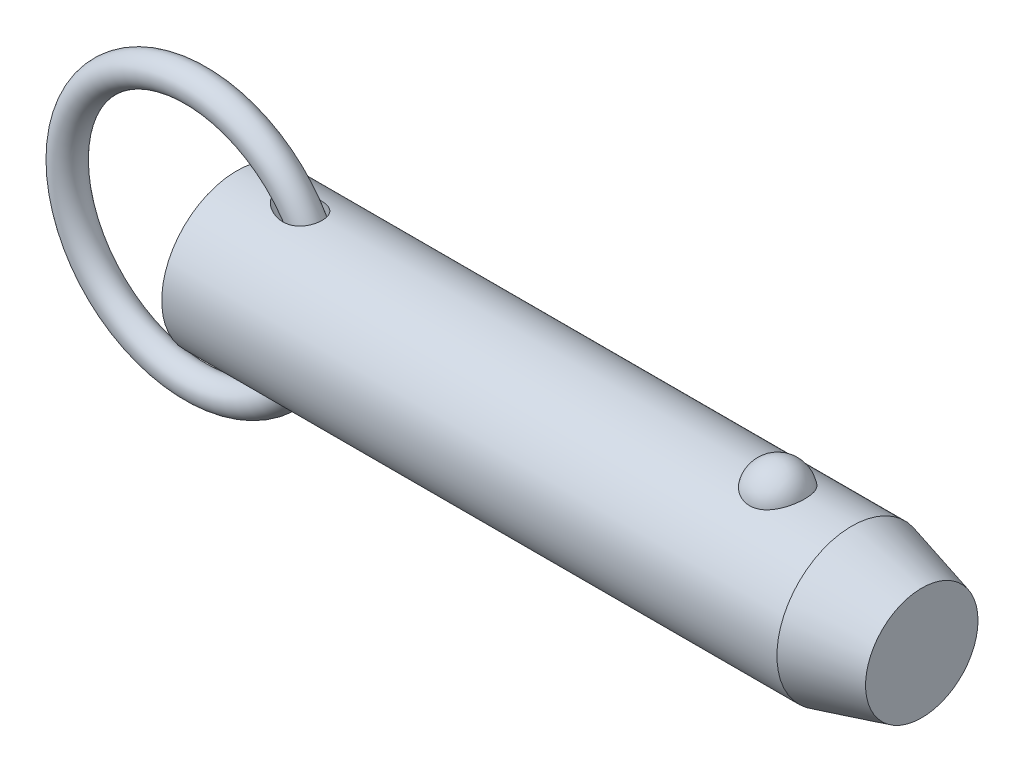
ISO-10303-21;
HEADER;
FILE_DESCRIPTION(('STEP AP214'),'2;1');
FILE_NAME('part.step','',(''),(''),'','','');
FILE_SCHEMA(('AUTOMOTIVE_DESIGN { 1 0 10303 214 1 1 1 1 }'));
ENDSEC;
DATA;
#1=APPLICATION_CONTEXT('core data for automotive mechanical design processes');
#2=APPLICATION_PROTOCOL_DEFINITION('international standard','automotive_design',2000,#1);
#3=PRODUCT_CONTEXT('',#1,'mechanical');
#4=PRODUCT('Part','Part','',(#3));
#5=PRODUCT_RELATED_PRODUCT_CATEGORY('part','',(#4));
#6=PRODUCT_DEFINITION_FORMATION('','',#4);
#7=PRODUCT_DEFINITION_CONTEXT('part definition',#1,'design');
#8=PRODUCT_DEFINITION('design','',#6,#7);
#9=PRODUCT_DEFINITION_SHAPE('','',#8);
#10=(LENGTH_UNIT() NAMED_UNIT(*) SI_UNIT(.MILLI.,.METRE.));
#11=(NAMED_UNIT(*) PLANE_ANGLE_UNIT() SI_UNIT($,.RADIAN.));
#12=(NAMED_UNIT(*) SI_UNIT($,.STERADIAN.) SOLID_ANGLE_UNIT());
#13=UNCERTAINTY_MEASURE_WITH_UNIT(LENGTH_MEASURE(1.E-05),#10,'distance_accuracy_value','');
#14=(GEOMETRIC_REPRESENTATION_CONTEXT(3) GLOBAL_UNCERTAINTY_ASSIGNED_CONTEXT((#13)) GLOBAL_UNIT_ASSIGNED_CONTEXT((#10,
#11,#12)) REPRESENTATION_CONTEXT('',''));
#15=CARTESIAN_POINT('',(0.,0.,0.));
#16=DIRECTION('',(0.,0.,1.));
#17=DIRECTION('',(1.,0.,0.));
#18=AXIS2_PLACEMENT_3D('',#15,#16,#17);
#19=CARTESIAN_POINT('',(-6.08699288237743,0.,0.));
#20=DIRECTION('',(0.,0.,1.));
#21=DIRECTION('',(1.,0.,0.));
#22=AXIS2_PLACEMENT_3D('',#19,#20,#21);
#23=TOROIDAL_SURFACE('',#22,19.05,2.223);
#24=CARTESIAN_POINT('',(15.1860071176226,0.,0.));
#25=VERTEX_POINT('',#24);
#26=VERTEX_LOOP('',#25);
#27=FACE_BOUND('',#26,.T.);
#28=ADVANCED_FACE('P0_F12',(#27),#23,.T.);
#29=CLOSED_SHELL('',(#28));
#30=MANIFOLD_SOLID_BREP('P0_B1',#29);
#31=CARTESIAN_POINT('',(0.,0.,0.));
#32=DIRECTION('',(1.,0.,0.));
#33=DIRECTION('',(0.,0.,-1.));
#34=AXIS2_PLACEMENT_3D('',#31,#32,#33);
#35=CYLINDRICAL_SURFACE('',#34,11.115);
#36=CARTESIAN_POINT('',(6.41405181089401,11.0227946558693,-1.4287136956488));
#37=CARTESIAN_POINT('',(6.49338916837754,11.0115377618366,-1.51556642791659));
#38=CARTESIAN_POINT('',(6.57765461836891,10.9998263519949,-1.59789397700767));
#39=CARTESIAN_POINT('',(6.75386647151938,10.9760304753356,-1.75391400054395));
#40=CARTESIAN_POINT('',(6.84582247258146,10.9639455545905,-1.82759540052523));
#41=CARTESIAN_POINT('',(7.03627827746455,10.9397989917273,-1.96698954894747));
#42=CARTESIAN_POINT('',(7.13480838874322,10.9277377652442,-2.03266078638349));
#43=CARTESIAN_POINT('',(7.33681032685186,10.9041015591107,-2.1558582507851));
#44=CARTESIAN_POINT('',(7.44028007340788,10.8925263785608,-2.21338786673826));
#45=CARTESIAN_POINT('',(7.64386117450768,10.8710104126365,-2.31666528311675));
#46=CARTESIAN_POINT('',(7.74368989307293,10.8610119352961,-2.36295942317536));
#47=CARTESIAN_POINT('',(7.94637195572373,10.8420168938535,-2.44863486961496));
#48=CARTESIAN_POINT('',(8.04922612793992,10.8330206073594,-2.48801426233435));
#49=CARTESIAN_POINT('',(8.36115573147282,10.807980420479,-2.59542730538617));
#50=CARTESIAN_POINT('',(8.57411849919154,10.7938278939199,-2.65299817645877));
#51=CARTESIAN_POINT('',(9.00825016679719,10.7725818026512,-2.73800108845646));
#52=CARTESIAN_POINT('',(9.22947335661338,10.7655491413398,-2.76517330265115));
#53=CARTESIAN_POINT('',(9.67368141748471,10.7605872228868,-2.78445308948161));
#54=CARTESIAN_POINT('',(9.89666486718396,10.7626512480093,-2.77658653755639));
#55=CARTESIAN_POINT('',(10.2950172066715,10.7754452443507,-2.72644436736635));
#56=CARTESIAN_POINT('',(10.4712789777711,10.7844280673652,-2.69109376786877));
#57=CARTESIAN_POINT('',(10.7292776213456,10.8024982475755,-2.61722365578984));
#58=CARTESIAN_POINT('',(10.8142337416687,10.8092901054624,-2.58911576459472));
#59=CARTESIAN_POINT('',(10.9813218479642,10.8242580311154,-2.52581287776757));
#60=CARTESIAN_POINT('',(11.0634550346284,10.8324335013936,-2.49062094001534));
#61=CARTESIAN_POINT('',(11.2247418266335,10.8500287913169,-2.41281958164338));
#62=CARTESIAN_POINT('',(11.3038694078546,10.8594572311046,-2.37015806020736));
#63=CARTESIAN_POINT('',(11.4576781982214,10.8792243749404,-2.27770403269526));
#64=CARTESIAN_POINT('',(11.5323615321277,10.8895626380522,-2.22791497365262));
#65=CARTESIAN_POINT('',(11.6765388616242,10.9108113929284,-2.12140590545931));
#66=CARTESIAN_POINT('',(11.7460329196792,10.9217218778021,-2.06468597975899));
#67=CARTESIAN_POINT('',(11.8790597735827,10.9437207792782,-1.94471764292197));
#68=CARTESIAN_POINT('',(11.9425932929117,10.9548091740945,-1.88147002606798));
#69=CARTESIAN_POINT('',(12.109388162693,10.9851999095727,-1.69784918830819));
#70=CARTESIAN_POINT('',(12.205655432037,11.0042655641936,-1.57093023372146));
#71=CARTESIAN_POINT('',(12.374151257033,11.0393391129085,-1.3017676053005));
#72=CARTESIAN_POINT('',(12.4463875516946,11.0553479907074,-1.15952888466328));
#73=CARTESIAN_POINT('',(12.5615818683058,11.0816338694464,-0.871972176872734));
#74=CARTESIAN_POINT('',(12.6058896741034,11.0921698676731,-0.727217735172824));
#75=CARTESIAN_POINT('',(12.6699315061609,11.1075802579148,-0.432089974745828));
#76=CARTESIAN_POINT('',(12.6896681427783,11.1124552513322,-0.281717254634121));
#77=CARTESIAN_POINT('',(12.7040225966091,11.1159901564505,0.0188164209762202));
#78=CARTESIAN_POINT('',(12.6988836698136,11.1147102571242,0.168965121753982));
#79=CARTESIAN_POINT('',(12.6641681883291,11.1062126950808,0.466238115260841));
#80=CARTESIAN_POINT('',(12.6345920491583,11.0989951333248,0.61336245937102));
#81=CARTESIAN_POINT('',(12.5517453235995,11.0794095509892,0.900330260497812));
#82=CARTESIAN_POINT('',(12.4984878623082,11.0670443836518,1.0401777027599));
#83=CARTESIAN_POINT('',(12.3696588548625,11.0385082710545,1.308745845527));
#84=CARTESIAN_POINT('',(12.2940887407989,11.0223375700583,1.43746725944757));
#85=CARTESIAN_POINT('',(12.122380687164,10.987872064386,1.68079704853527));
#86=CARTESIAN_POINT('',(12.0261637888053,10.969569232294,1.79534850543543));
#87=CARTESIAN_POINT('',(11.8161707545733,10.932836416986,2.00695695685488));
#88=CARTESIAN_POINT('',(11.7023941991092,10.9144064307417,2.10401353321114));
#89=CARTESIAN_POINT('',(11.4575656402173,10.8788057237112,2.28105326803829));
#90=CARTESIAN_POINT('',(11.3261451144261,10.8616794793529,2.36053412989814));
#91=CARTESIAN_POINT('',(11.0523589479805,10.8308019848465,2.49839044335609));
#92=CARTESIAN_POINT('',(10.9099908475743,10.8170514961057,2.55676113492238));
#93=CARTESIAN_POINT('',(10.6060622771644,10.7929728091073,2.65666105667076));
#94=CARTESIAN_POINT('',(10.4438877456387,10.7830209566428,2.69640163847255));
#95=CARTESIAN_POINT('',(10.1154037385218,10.7687230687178,2.75293129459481));
#96=CARTESIAN_POINT('',(9.94909141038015,10.7643810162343,2.76970406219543));
#97=CARTESIAN_POINT('',(9.54387061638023,10.7604809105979,2.7848723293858));
#98=CARTESIAN_POINT('',(9.30446860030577,10.7637793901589,2.77227753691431));
#99=CARTESIAN_POINT('',(8.9496125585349,10.7757341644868,2.72524141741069));
#100=CARTESIAN_POINT('',(8.83186896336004,10.7808994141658,2.70482239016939));
#101=CARTESIAN_POINT('',(8.59835142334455,10.7932548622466,2.6550999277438));
#102=CARTESIAN_POINT('',(8.48257728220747,10.8004448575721,2.62579738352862));
#103=CARTESIAN_POINT('',(8.25208469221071,10.8166382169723,2.55827624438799));
#104=CARTESIAN_POINT('',(8.13740214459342,10.8256649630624,2.51994155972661));
#105=CARTESIAN_POINT('',(7.91132058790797,10.8451170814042,2.43486475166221));
#106=CARTESIAN_POINT('',(7.79992154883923,10.8555424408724,2.38812270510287));
#107=CARTESIAN_POINT('',(7.58115677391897,10.8774251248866,2.28638483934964));
#108=CARTESIAN_POINT('',(7.47378802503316,10.8888816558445,2.23139534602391));
#109=CARTESIAN_POINT('',(7.26385624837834,10.9124540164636,2.1131026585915));
#110=CARTESIAN_POINT('',(7.16129168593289,10.9245696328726,2.04980214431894));
#111=CARTESIAN_POINT('',(6.91882218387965,10.9543689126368,1.88540538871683));
#112=CARTESIAN_POINT('',(6.78193778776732,10.9721958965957,1.77979827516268));
#113=CARTESIAN_POINT('',(6.5247244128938,11.0070222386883,1.54989693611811));
#114=CARTESIAN_POINT('',(6.40436902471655,11.0240228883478,1.42563320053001));
#115=CARTESIAN_POINT('',(6.21838804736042,11.0509658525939,1.19529359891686));
#116=CARTESIAN_POINT('',(6.14691885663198,11.0615430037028,1.09404520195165));
#117=CARTESIAN_POINT('',(6.02043496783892,11.0805004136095,0.881508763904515));
#118=CARTESIAN_POINT('',(5.96539400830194,11.0888841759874,0.770237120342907));
#119=CARTESIAN_POINT('',(5.88475453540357,11.1012553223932,0.560577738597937));
#120=CARTESIAN_POINT('',(5.85559643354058,11.1057686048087,0.463603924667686));
#121=CARTESIAN_POINT('',(5.81381299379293,11.1122523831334,0.266083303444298));
#122=CARTESIAN_POINT('',(5.80117118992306,11.1142254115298,0.165540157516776));
#123=CARTESIAN_POINT('',(5.79363815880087,11.1153999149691,-0.036474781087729));
#124=CARTESIAN_POINT('',(5.79878799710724,11.1145949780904,-0.137948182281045));
#125=CARTESIAN_POINT('',(5.82639592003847,11.1102987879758,-0.338493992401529));
#126=CARTESIAN_POINT('',(5.84887234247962,11.1068046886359,-0.43756374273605));
#127=CARTESIAN_POINT('',(5.91510741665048,11.0965857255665,-0.649968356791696));
#128=CARTESIAN_POINT('',(5.9622090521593,11.0893566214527,-0.762222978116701));
#129=CARTESIAN_POINT('',(6.07378449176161,11.072471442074,-0.977396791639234));
#130=CARTESIAN_POINT('',(6.13826787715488,11.0628140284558,-1.08031079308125));
#131=CARTESIAN_POINT('',(6.2410107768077,11.0477136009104,-1.2219580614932));
#132=CARTESIAN_POINT('',(6.27403486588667,11.042895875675,-1.26469183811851));
#133=CARTESIAN_POINT('',(6.34238022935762,11.0330152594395,-1.34817011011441));
#134=CARTESIAN_POINT('',(6.37769867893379,11.0279526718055,-1.38891694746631));
#135=CARTESIAN_POINT('',(6.41405181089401,11.0227946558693,-1.4287136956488));
#136=B_SPLINE_CURVE_WITH_KNOTS('',3,(#36,#37,#38,#39,#40,#41,#42,#43,#44,#45,#46,#47,#48,#49,
#50,#51,#52,#53,#54,#55,#56,#57,#58,#59,#60,#61,#62,#63,#64,#65,#66,#67,#68,#69,#70,#71,#72,#73,
#74,#75,#76,#77,#78,#79,#80,#81,#82,#83,#84,#85,#86,#87,#88,#89,#90,#91,#92,#93,#94,#95,#96,#97,
#98,#99,#100,#101,#102,#103,#104,#105,#106,#107,#108,#109,#110,#111,#112,#113,#114,#115,#116,
#117,#118,#119,#120,#121,#122,#123,#124,#125,#126,#127,#128,#129,#130,#131,#132,#133,#134,#135),
.UNSPECIFIED.,.T.,.F.,(4,2,2,2,2,2,2,2,2,2,2,2,2,2,2,2,2,2,2,2,2,2,2,2,2,2,2,2,2,2,2,2,2,2,2,2,
2,2,2,2,2,2,2,2,2,2,2,2,2,4),(0.,0.35443329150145,0.709315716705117,1.0659654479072,
1.42246628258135,1.7536715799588,2.08496839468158,2.74582009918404,3.41227815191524,
4.07824412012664,4.61583787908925,4.88478112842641,5.1536085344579,5.42439170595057,
5.69504436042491,5.96569375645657,6.23631025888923,6.71490729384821,7.19335005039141,
7.64641437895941,8.09943057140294,8.54802575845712,8.99661331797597,9.44495256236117,
9.89326303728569,10.3433195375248,10.7933867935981,11.2550086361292,11.7167345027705,
12.2165866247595,12.7167934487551,13.4318876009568,13.7904664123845,14.1490092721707,
14.5124394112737,14.8758662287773,15.239015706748,15.6020483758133,16.1219860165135,
16.6410830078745,17.0130520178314,17.3844231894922,17.6872330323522,17.9897407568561,
18.2929471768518,18.5964749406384,18.9603532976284,19.3244326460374,19.4870338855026,
19.649438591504),.UNSPECIFIED.);
#137=CARTESIAN_POINT('',(6.41405181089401,11.0227946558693,-1.4287136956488));
#138=VERTEX_POINT('',#137);
#139=EDGE_CURVE('P1_E40',#138,#138,#136,.T.);
#140=ORIENTED_EDGE('',*,*,#139,.T.);
#141=EDGE_LOOP('',(#140));
#142=FACE_BOUND('',#141,.T.);
#143=CARTESIAN_POINT('',(91.229563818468,0.,0.));
#144=DIRECTION('',(1.,0.,0.));
#145=DIRECTION('',(0.,0.,-1.));
#146=AXIS2_PLACEMENT_3D('',#143,#144,#145);
#147=CIRCLE('',#146,11.115);
#148=CARTESIAN_POINT('',(91.229563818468,0.,-11.115));
#149=VERTEX_POINT('',#148);
#150=EDGE_CURVE('P1_E25',#149,#149,#147,.T.);
#151=ORIENTED_EDGE('',*,*,#150,.F.);
#152=EDGE_LOOP('',(#151));
#153=FACE_BOUND('',#152,.T.);
#154=CARTESIAN_POINT('',(0.,0.,0.));
#155=DIRECTION('',(1.,0.,0.));
#156=DIRECTION('',(0.,0.,-1.));
#157=AXIS2_PLACEMENT_3D('',#154,#155,#156);
#158=CIRCLE('',#157,11.115);
#159=CARTESIAN_POINT('',(0.,0.,-11.115));
#160=VERTEX_POINT('',#159);
#161=EDGE_CURVE('P1_E9',#160,#160,#158,.T.);
#162=ORIENTED_EDGE('',*,*,#161,.T.);
#163=EDGE_LOOP('',(#162));
#164=FACE_BOUND('',#163,.T.);
#165=CARTESIAN_POINT('',(80.2310680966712,10.3028087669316,4.17077409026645));
#166=CARTESIAN_POINT('',(80.0147756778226,10.3028003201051,4.17078240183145));
#167=CARTESIAN_POINT('',(79.7985488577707,10.3098895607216,4.15340593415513));
#168=CARTESIAN_POINT('',(79.3725408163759,10.3373834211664,4.08449540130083));
#169=CARTESIAN_POINT('',(79.1627577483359,10.3577841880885,4.0329712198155));
#170=CARTESIAN_POINT('',(78.7557825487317,10.4095237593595,3.89746513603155));
#171=CARTESIAN_POINT('',(78.5585726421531,10.4408466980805,3.81353029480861));
#172=CARTESIAN_POINT('',(78.1813382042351,10.5110236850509,3.61560339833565));
#173=CARTESIAN_POINT('',(78.0013171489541,10.5498792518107,3.50160528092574));
#174=CARTESIAN_POINT('',(77.6576842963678,10.6322884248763,3.24292464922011));
#175=CARTESIAN_POINT('',(77.4946861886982,10.6759443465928,3.09746040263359));
#176=CARTESIAN_POINT('',(77.1945911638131,10.7625291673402,2.78171925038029));
#177=CARTESIAN_POINT('',(77.0574990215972,10.8054579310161,2.61143778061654));
#178=CARTESIAN_POINT('',(76.8064084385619,10.8881935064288,2.24226695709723));
#179=CARTESIAN_POINT('',(76.6937105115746,10.9277761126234,2.04244123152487));
#180=CARTESIAN_POINT('',(76.5017771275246,10.997484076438,1.62578254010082));
#181=CARTESIAN_POINT('',(76.4225446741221,11.0276085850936,1.40894804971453));
#182=CARTESIAN_POINT('',(76.2983034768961,11.0756732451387,0.961250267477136));
#183=CARTESIAN_POINT('',(76.253760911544,11.0934470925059,0.730239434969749));
#184=CARTESIAN_POINT('',(76.2015695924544,11.1143331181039,0.263439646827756));
#185=CARTESIAN_POINT('',(76.1939200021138,11.1174456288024,0.0276507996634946));
#186=CARTESIAN_POINT('',(76.2156105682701,11.1087161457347,-0.440729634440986));
#187=CARTESIAN_POINT('',(76.2447624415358,11.0969502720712,-0.673331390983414));
#188=CARTESIAN_POINT('',(76.3391432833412,11.0597872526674,-1.12996621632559));
#189=CARTESIAN_POINT('',(76.4043729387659,11.0343898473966,-1.35399912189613));
#190=CARTESIAN_POINT('',(76.5696984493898,10.972515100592,-1.78750286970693));
#191=CARTESIAN_POINT('',(76.6698386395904,10.9360236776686,-1.99695478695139));
#192=CARTESIAN_POINT('',(76.9029408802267,10.8557595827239,-2.3952066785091));
#193=CARTESIAN_POINT('',(77.0359054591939,10.8119863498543,-2.5840050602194));
#194=CARTESIAN_POINT('',(77.332407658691,10.7216733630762,-2.93635726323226));
#195=CARTESIAN_POINT('',(77.4960565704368,10.675123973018,-3.09981510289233));
#196=CARTESIAN_POINT('',(77.8498601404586,10.5846571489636,-3.39592247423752));
#197=CARTESIAN_POINT('',(78.0400123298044,10.5407394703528,-3.52857487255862));
#198=CARTESIAN_POINT('',(78.4375014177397,10.4616690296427,-3.75646057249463));
#199=CARTESIAN_POINT('',(78.6443670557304,10.4263443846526,-3.85245432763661));
#200=CARTESIAN_POINT('',(79.0729541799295,10.3675574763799,-4.00798747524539));
#201=CARTESIAN_POINT('',(79.294670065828,10.344090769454,-4.0675405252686));
#202=CARTESIAN_POINT('',(79.7346695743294,10.3128282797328,-4.14614314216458));
#203=CARTESIAN_POINT('',(79.9525654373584,10.3043040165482,-4.1670783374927));
#204=CARTESIAN_POINT('',(80.38894951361,10.3016771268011,-4.17357158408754));
#205=CARTESIAN_POINT('',(80.6074376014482,10.3075716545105,-4.15913661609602));
#206=CARTESIAN_POINT('',(81.0317442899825,10.3326686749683,-4.09636961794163));
#207=CARTESIAN_POINT('',(81.2377458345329,10.3514555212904,-4.0490957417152));
#208=CARTESIAN_POINT('',(81.6385764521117,10.399818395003,-3.92320197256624));
#209=CARTESIAN_POINT('',(81.8334046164,10.4293952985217,-3.84457953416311));
#210=CARTESIAN_POINT('',(82.2111917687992,10.4969600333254,-3.65612410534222));
#211=CARTESIAN_POINT('',(82.3937974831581,10.5351178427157,-3.54564545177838));
#212=CARTESIAN_POINT('',(82.7382040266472,10.6154999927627,-3.2971803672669));
#213=CARTESIAN_POINT('',(82.900000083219,10.657725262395,-3.15918764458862));
#214=CARTESIAN_POINT('',(83.2069596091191,10.744212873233,-2.85163580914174));
#215=CARTESIAN_POINT('',(83.3508919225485,10.7884718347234,-2.68084605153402));
#216=CARTESIAN_POINT('',(83.6092371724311,10.872374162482,-2.3172186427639));
#217=CARTESIAN_POINT('',(83.7236448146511,10.9120167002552,-2.12437704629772));
#218=CARTESIAN_POINT('',(83.9238739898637,10.9838919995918,-1.71516999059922));
#219=CARTESIAN_POINT('',(84.0086617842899,11.0158465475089,-1.498248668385));
#220=CARTESIAN_POINT('',(84.1426838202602,11.0673523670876,-1.05228572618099));
#221=CARTESIAN_POINT('',(84.1919174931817,11.086903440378,-0.823243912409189));
#222=CARTESIAN_POINT('',(84.2538915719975,11.1116323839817,-0.359087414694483));
#223=CARTESIAN_POINT('',(84.2665662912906,11.1167843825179,-0.123962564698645));
#224=CARTESIAN_POINT('',(84.254973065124,11.1121144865,0.345220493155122));
#225=CARTESIAN_POINT('',(84.2307056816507,11.1022928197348,0.579278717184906));
#226=CARTESIAN_POINT('',(84.1459073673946,11.0687504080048,1.03866534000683));
#227=CARTESIAN_POINT('',(84.0855299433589,11.0450885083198,1.26402641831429));
#228=CARTESIAN_POINT('',(83.9298532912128,10.9863185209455,1.70076772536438));
#229=CARTESIAN_POINT('',(83.834551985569,10.9512097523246,1.91214712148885));
#230=CARTESIAN_POINT('',(83.6103974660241,10.8729733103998,2.31608359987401));
#231=CARTESIAN_POINT('',(83.4813806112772,10.8298068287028,2.50854240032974));
#232=CARTESIAN_POINT('',(83.1927327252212,10.7401896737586,2.86808766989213));
#233=CARTESIAN_POINT('',(83.0331022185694,10.6937390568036,3.03517457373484));
#234=CARTESIAN_POINT('',(82.6875341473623,10.6029321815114,3.33857581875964));
#235=CARTESIAN_POINT('',(82.5017089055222,10.5585680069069,3.47501541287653));
#236=CARTESIAN_POINT('',(82.1078750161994,10.4769321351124,3.71390897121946));
#237=CARTESIAN_POINT('',(81.8998635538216,10.439661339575,3.81635861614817));
#238=CARTESIAN_POINT('',(81.4540666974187,10.3749407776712,3.98910631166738));
#239=CARTESIAN_POINT('',(81.2152342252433,10.3482457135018,4.05700929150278));
#240=CARTESIAN_POINT('',(80.7279254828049,10.312188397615,4.14782844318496));
#241=CARTESIAN_POINT('',(80.4794535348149,10.3028184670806,4.17076454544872));
#242=CARTESIAN_POINT('',(80.2310680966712,10.3028087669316,4.17077409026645));
#243=B_SPLINE_CURVE_WITH_KNOTS('',3,(#165,#166,#167,#168,#169,#170,#171,#172,#173,#174,#175,
#176,#177,#178,#179,#180,#181,#182,#183,#184,#185,#186,#187,#188,#189,#190,#191,#192,#193,#194,
#195,#196,#197,#198,#199,#200,#201,#202,#203,#204,#205,#206,#207,#208,#209,#210,#211,#212,#213,
#214,#215,#216,#217,#218,#219,#220,#221,#222,#223,#224,#225,#226,#227,#228,#229,#230,#231,#232,
#233,#234,#235,#236,#237,#238,#239,#240,#241,#242),.UNSPECIFIED.,.T.,.F.,(4,2,2,2,2,2,2,2,2,2,2,
2,2,2,2,2,2,2,2,2,2,2,2,2,2,2,2,2,2,2,2,2,2,2,2,2,2,2,4),(0.,0.647966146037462,1.29574482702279,
1.94258643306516,2.58955857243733,3.25496465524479,3.92049326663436,4.61566368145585,
5.3108964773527,6.01531821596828,6.71972398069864,7.42054043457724,8.12137023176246,
8.82309331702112,9.52487047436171,10.2292439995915,10.9335519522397,11.6223330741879,
12.3108558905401,12.9647664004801,13.6185478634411,14.2521847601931,14.8858731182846,
15.5334360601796,16.1811472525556,16.8611459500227,17.5412664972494,18.2431855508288,
18.9451158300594,19.6483065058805,20.3514864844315,21.0516982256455,21.7519516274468,
22.4556690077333,23.1593743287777,23.8601491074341,24.5610129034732,25.3054529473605,
26.049562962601),.UNSPECIFIED.);
#244=CARTESIAN_POINT('',(80.2310680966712,10.3028087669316,4.17077409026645));
#245=VERTEX_POINT('',#244);
#246=EDGE_CURVE('P1_E34',#245,#245,#243,.T.);
#247=ORIENTED_EDGE('',*,*,#246,.T.);
#248=EDGE_LOOP('',(#247));
#249=FACE_BOUND('',#248,.T.);
#250=CARTESIAN_POINT('',(6.41405181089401,-11.0227946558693,-1.4287136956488));
#251=CARTESIAN_POINT('',(6.33124061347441,-11.0345445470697,-1.33806125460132));
#252=CARTESIAN_POINT('',(6.25372866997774,-11.0458090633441,-1.24240732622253));
#253=CARTESIAN_POINT('',(6.11277905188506,-11.0666115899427,-1.04095704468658));
#254=CARTESIAN_POINT('',(6.0493392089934,-11.0761498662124,-0.935162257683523));
#255=CARTESIAN_POINT('',(5.94029181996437,-11.0927063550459,-0.712476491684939));
#256=CARTESIAN_POINT('',(5.89492964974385,-11.0996897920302,-0.595457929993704));
#257=CARTESIAN_POINT('',(5.8449816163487,-11.1074141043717,-0.414997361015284));
#258=CARTESIAN_POINT('',(5.83135004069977,-11.1095300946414,-0.354047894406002));
#259=CARTESIAN_POINT('',(5.81051649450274,-11.1127688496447,-0.231041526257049));
#260=CARTESIAN_POINT('',(5.80331311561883,-11.1138918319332,-0.1689848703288));
#261=CARTESIAN_POINT('',(5.79296529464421,-11.1155042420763,-0.000484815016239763));
#262=CARTESIAN_POINT('',(5.79625267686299,-11.1149904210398,0.106437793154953));
#263=CARTESIAN_POINT('',(5.82213676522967,-11.1109609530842,0.317809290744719));
#264=CARTESIAN_POINT('',(5.84474662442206,-11.1074432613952,0.422256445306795));
#265=CARTESIAN_POINT('',(5.91113114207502,-11.097197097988,0.63936180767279));
#266=CARTESIAN_POINT('',(5.95733120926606,-11.090102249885,0.751250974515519));
#267=CARTESIAN_POINT('',(6.06709542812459,-11.0734770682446,0.965912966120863));
#268=CARTESIAN_POINT('',(6.13068735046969,-11.06394284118,1.06867085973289));
#269=CARTESIAN_POINT('',(6.30294237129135,-11.0385920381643,1.30890635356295));
#270=CARTESIAN_POINT('',(6.4189620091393,-11.0218881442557,1.44097376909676));
#271=CARTESIAN_POINT('',(6.66989654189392,-10.9871512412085,1.68553954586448));
#272=CARTESIAN_POINT('',(6.80485520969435,-10.9691152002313,1.79799117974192));
#273=CARTESIAN_POINT('',(7.04881236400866,-10.9382283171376,1.97587596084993));
#274=CARTESIAN_POINT('',(7.15465712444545,-10.9253240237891,2.04570822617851));
#275=CARTESIAN_POINT('',(7.37202504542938,-10.9000987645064,2.17611840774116));
#276=CARTESIAN_POINT('',(7.48355057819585,-10.8877780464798,2.23669241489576));
#277=CARTESIAN_POINT('',(7.71132418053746,-10.8641580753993,2.34873831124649));
#278=CARTESIAN_POINT('',(7.82757727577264,-10.8528599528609,2.40020018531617));
#279=CARTESIAN_POINT('',(8.06386825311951,-10.8317234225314,2.49385169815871));
#280=CARTESIAN_POINT('',(8.18390558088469,-10.8218848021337,2.53604268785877));
#281=CARTESIAN_POINT('',(8.42918336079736,-10.8039208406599,2.61152283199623));
#282=CARTESIAN_POINT('',(8.55447802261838,-10.7958283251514,2.64464414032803));
#283=CARTESIAN_POINT('',(8.80752127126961,-10.781995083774,2.70048793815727));
#284=CARTESIAN_POINT('',(8.9352701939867,-10.7762546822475,2.72320899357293));
#285=CARTESIAN_POINT('',(9.19210176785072,-10.7675291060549,2.75750994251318));
#286=CARTESIAN_POINT('',(9.32118105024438,-10.7645381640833,2.76911315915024));
#287=CARTESIAN_POINT('',(9.57984338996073,-10.761622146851,2.78042035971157));
#288=CARTESIAN_POINT('',(9.70942621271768,-10.7616957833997,2.78012934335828));
#289=CARTESIAN_POINT('',(10.0243125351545,-10.7659059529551,2.76381534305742));
#290=CARTESIAN_POINT('',(10.209307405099,-10.7717977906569,2.74099674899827));
#291=CARTESIAN_POINT('',(10.5731188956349,-10.7905408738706,2.66626238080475));
#292=CARTESIAN_POINT('',(10.7519389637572,-10.8033881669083,2.61436313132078));
#293=CARTESIAN_POINT('',(11.0114289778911,-10.8271584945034,2.51336808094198));
#294=CARTESIAN_POINT('',(11.0968318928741,-10.835881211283,2.47562331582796));
#295=CARTESIAN_POINT('',(11.2636000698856,-10.8545688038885,2.39236170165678));
#296=CARTESIAN_POINT('',(11.344967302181,-10.8645330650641,2.3468486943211));
#297=CARTESIAN_POINT('',(11.5027832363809,-10.8853818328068,2.24815967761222));
#298=CARTESIAN_POINT('',(11.5792327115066,-10.8962661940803,2.19498487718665));
#299=CARTESIAN_POINT('',(11.7263315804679,-10.9185541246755,2.08128855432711));
#300=CARTESIAN_POINT('',(11.7969818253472,-10.9299576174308,2.02076811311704));
#301=CARTESIAN_POINT('',(11.9817953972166,-10.9613645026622,1.84513663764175));
#302=CARTESIAN_POINT('',(12.0893012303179,-10.9814643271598,1.72286660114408));
#303=CARTESIAN_POINT('',(12.2803576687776,-11.0193991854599,1.46066991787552));
#304=CARTESIAN_POINT('',(12.3639173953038,-11.0372350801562,1.32075002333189));
#305=CARTESIAN_POINT('',(12.4996220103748,-11.0672969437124,1.03778067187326));
#306=CARTESIAN_POINT('',(12.5535315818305,-11.0798242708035,0.895607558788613));
#307=CARTESIAN_POINT('',(12.636874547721,-11.0995427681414,0.603918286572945));
#308=CARTESIAN_POINT('',(12.6663115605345,-11.1067347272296,0.454403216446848));
#309=CARTESIAN_POINT('',(12.6997387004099,-11.1149224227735,0.154577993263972));
#310=CARTESIAN_POINT('',(12.7040886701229,-11.1160057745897,0.00431019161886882));
#311=CARTESIAN_POINT('',(12.6882048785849,-11.1120956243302,-0.294841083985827));
#312=CARTESIAN_POINT('',(12.6679715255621,-11.1071022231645,-0.44372458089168));
#313=CARTESIAN_POINT('',(12.6034470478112,-11.0915888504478,-0.735688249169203));
#314=CARTESIAN_POINT('',(12.5591858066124,-11.0810757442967,-0.878775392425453));
#315=CARTESIAN_POINT('',(12.4477416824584,-11.0556687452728,-1.15529525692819));
#316=CARTESIAN_POINT('',(12.3805601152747,-11.0407751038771,-1.2887285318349));
#317=CARTESIAN_POINT('',(12.2248919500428,-11.0081839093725,-1.54257976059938));
#318=CARTESIAN_POINT('',(12.1363549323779,-10.9904797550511,-1.66296592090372));
#319=CARTESIAN_POINT('',(11.9406137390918,-10.9541951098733,-1.88726577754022));
#320=CARTESIAN_POINT('',(11.833409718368,-10.9356146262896,-1.99117961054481));
#321=CARTESIAN_POINT('',(11.601318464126,-10.8991360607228,-2.18213646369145));
#322=CARTESIAN_POINT('',(11.4761325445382,-10.8812577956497,-2.26881927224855));
#323=CARTESIAN_POINT('',(11.2134852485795,-10.8482871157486,-2.42157282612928));
#324=CARTESIAN_POINT('',(11.0760218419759,-10.8331951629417,-2.48764015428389));
#325=CARTESIAN_POINT('',(10.7828968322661,-10.8061050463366,-2.60290068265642));
#326=CARTESIAN_POINT('',(10.6266338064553,-10.7943907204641,-2.65062248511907));
#327=CARTESIAN_POINT('',(10.3086617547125,-10.7762429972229,-2.72345054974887));
#328=CARTESIAN_POINT('',(10.146948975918,-10.7698133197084,-2.74854088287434));
#329=CARTESIAN_POINT('',(9.75541304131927,-10.7608036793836,-2.78368719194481));
#330=CARTESIAN_POINT('',(9.52459435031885,-10.7608467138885,-2.78350276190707));
#331=CARTESIAN_POINT('',(9.06604960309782,-10.7702674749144,-2.74677945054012));
#332=CARTESIAN_POINT('',(8.83832966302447,-10.7796615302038,-2.71017697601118));
#333=CARTESIAN_POINT('',(8.38783466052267,-10.8058248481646,-2.60392490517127));
#334=CARTESIAN_POINT('',(8.16517101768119,-10.8226939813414,-2.53382676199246));
#335=CARTESIAN_POINT('',(7.84087311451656,-10.8516548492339,-2.40555545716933));
#336=CARTESIAN_POINT('',(7.73435551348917,-10.8619221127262,-2.35892455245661));
#337=CARTESIAN_POINT('',(7.52510420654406,-10.883357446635,-2.25797017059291));
#338=CARTESIAN_POINT('',(7.4223698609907,-10.8945253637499,-2.20364800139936));
#339=CARTESIAN_POINT('',(7.23808758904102,-10.915528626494,-2.09688018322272));
#340=CARTESIAN_POINT('',(7.15584631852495,-10.9252787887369,-2.0456107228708));
#341=CARTESIAN_POINT('',(6.99510576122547,-10.944960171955,-1.93754729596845));
#342=CARTESIAN_POINT('',(6.91660574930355,-10.9548913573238,-1.88075440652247));
#343=CARTESIAN_POINT('',(6.76418133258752,-10.974690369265,-1.76154504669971));
#344=CARTESIAN_POINT('',(6.69024940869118,-10.9845582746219,-1.6991382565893));
#345=CARTESIAN_POINT('',(6.54780119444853,-11.0039826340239,-1.56842485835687));
#346=CARTESIAN_POINT('',(6.47928247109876,-11.0135392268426,-1.50012092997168));
#347=CARTESIAN_POINT('',(6.41405181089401,-11.0227946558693,-1.4287136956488));
#348=B_SPLINE_CURVE_WITH_KNOTS('',3,(#250,#251,#252,#253,#254,#255,#256,#257,#258,#259,#260,
#261,#262,#263,#264,#265,#266,#267,#268,#269,#270,#271,#272,#273,#274,#275,#276,#277,#278,#279,
#280,#281,#282,#283,#284,#285,#286,#287,#288,#289,#290,#291,#292,#293,#294,#295,#296,#297,#298,
#299,#300,#301,#302,#303,#304,#305,#306,#307,#308,#309,#310,#311,#312,#313,#314,#315,#316,#317,
#318,#319,#320,#321,#322,#323,#324,#325,#326,#327,#328,#329,#330,#331,#332,#333,#334,#335,#336,
#337,#338,#339,#340,#341,#342,#343,#344,#345,#346,#347),.UNSPECIFIED.,.T.,.F.,(4,2,2,2,2,2,2,2,
2,2,2,2,2,2,2,2,2,2,2,2,2,2,2,2,2,2,2,2,2,2,2,2,2,2,2,2,2,2,2,2,2,2,2,2,2,2,2,2,4),(0.,
0.36983565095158,0.739614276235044,1.1142538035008,1.30141910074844,1.48854338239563,
1.8074587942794,2.12659146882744,2.4883888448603,2.85076733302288,3.3776216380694,
3.90571433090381,4.287639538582,4.66972556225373,5.05222896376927,5.43467659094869,
5.82378546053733,6.21294796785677,6.6012922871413,6.98947336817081,7.54669558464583,
8.10360148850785,8.3845853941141,8.66543074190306,8.94623182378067,9.22699162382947,
9.7162888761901,10.2053995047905,10.6608871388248,11.1163074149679,11.5651786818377,
12.0140424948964,12.4623493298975,12.9106304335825,13.3599804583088,13.8093267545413,
14.2672570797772,14.7252632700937,15.214740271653,15.7045615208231,16.3932594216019,
17.083162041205,17.7825738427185,18.1325177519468,18.4824022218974,18.7744056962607,
19.0663523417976,19.3578048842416,19.6491256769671),.UNSPECIFIED.);
#349=CARTESIAN_POINT('',(6.41405181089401,-11.0227946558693,-1.4287136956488));
#350=VERTEX_POINT('',#349);
#351=EDGE_CURVE('P1_E17',#350,#350,#348,.T.);
#352=ORIENTED_EDGE('',*,*,#351,.T.);
#353=EDGE_LOOP('',(#352));
#354=FACE_BOUND('',#353,.T.);
#355=ADVANCED_FACE('P1_F13',(#142,#153,#164,#249,#354),#35,.T.);
#356=CARTESIAN_POINT('',(0.,0.,0.));
#357=DIRECTION('',(-1.,0.,0.));
#358=DIRECTION('',(0.,0.,1.));
#359=AXIS2_PLACEMENT_3D('',#356,#357,#358);
#360=PLANE('',#359);
#361=ORIENTED_EDGE('',*,*,#161,.F.);
#362=EDGE_LOOP('',(#361));
#363=FACE_BOUND('',#362,.T.);
#364=ADVANCED_FACE('P1_F15',(#363),#360,.T.);
#365=CARTESIAN_POINT('',(101.6,0.,0.));
#366=DIRECTION('',(-1.,0.,0.));
#367=DIRECTION('',(0.,0.,1.));
#368=AXIS2_PLACEMENT_3D('',#365,#366,#367);
#369=CONICAL_SURFACE('',#368,8.33625000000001,0.26179938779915);
#370=ORIENTED_EDGE('',*,*,#150,.T.);
#371=EDGE_LOOP('',(#370));
#372=FACE_BOUND('',#371,.T.);
#373=CARTESIAN_POINT('',(101.6,0.,0.));
#374=DIRECTION('',(1.,0.,0.));
#375=DIRECTION('',(0.,0.,-1.));
#376=AXIS2_PLACEMENT_3D('',#373,#374,#375);
#377=CIRCLE('',#376,8.33625000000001);
#378=CARTESIAN_POINT('',(101.6,0.,-8.33625000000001));
#379=VERTEX_POINT('',#378);
#380=EDGE_CURVE('P1_E30',#379,#379,#377,.T.);
#381=ORIENTED_EDGE('',*,*,#380,.F.);
#382=EDGE_LOOP('',(#381));
#383=FACE_BOUND('',#382,.T.);
#384=ADVANCED_FACE('P1_F55',(#372,#383),#369,.T.);
#385=CARTESIAN_POINT('',(101.6,8.33625000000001,0.));
#386=DIRECTION('',(1.,0.,0.));
#387=DIRECTION('',(0.,0.,-1.));
#388=AXIS2_PLACEMENT_3D('',#385,#386,#387);
#389=PLANE('',#388);
#390=ORIENTED_EDGE('',*,*,#380,.T.);
#391=EDGE_LOOP('',(#390));
#392=FACE_BOUND('',#391,.T.);
#393=ADVANCED_FACE('P1_F51',(#392),#389,.T.);
#394=CARTESIAN_POINT('',(80.2310680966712,10.0035,0.));
#395=DIRECTION('',(-1.,0.,0.));
#396=DIRECTION('',(0.,-1.,0.));
#397=AXIS2_PLACEMENT_3D('',#394,#395,#396);
#398=SPHERICAL_SURFACE('',#397,4.18150000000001);
#399=ORIENTED_EDGE('',*,*,#246,.F.);
#400=EDGE_LOOP('',(#399));
#401=FACE_BOUND('',#400,.T.);
#402=ADVANCED_FACE('P1_F46',(#401),#398,.T.);
#403=CARTESIAN_POINT('',(-6.08699288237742,0.,0.));
#404=DIRECTION('',(0.,0.,1.));
#405=DIRECTION('',(1.,0.,0.));
#406=AXIS2_PLACEMENT_3D('',#403,#404,#405);
#407=TOROIDAL_SURFACE('',#406,19.05,2.77875);
#408=ORIENTED_EDGE('',*,*,#351,.F.);
#409=EDGE_LOOP('',(#408));
#410=FACE_BOUND('',#409,.T.);
#411=ORIENTED_EDGE('',*,*,#139,.F.);
#412=EDGE_LOOP('',(#411));
#413=FACE_BOUND('',#412,.T.);
#414=ADVANCED_FACE('P1_F50',(#410,#413),#407,.F.);
#415=CLOSED_SHELL('',(#355,#364,#384,#393,#402,#414));
#416=MANIFOLD_SOLID_BREP('P1_B1',#415);
#417=ADVANCED_BREP_SHAPE_REPRESENTATION('',(#18,#30,#416),#14);
#418=SHAPE_DEFINITION_REPRESENTATION(#9,#417);
ENDSEC;
END-ISO-10303-21;
